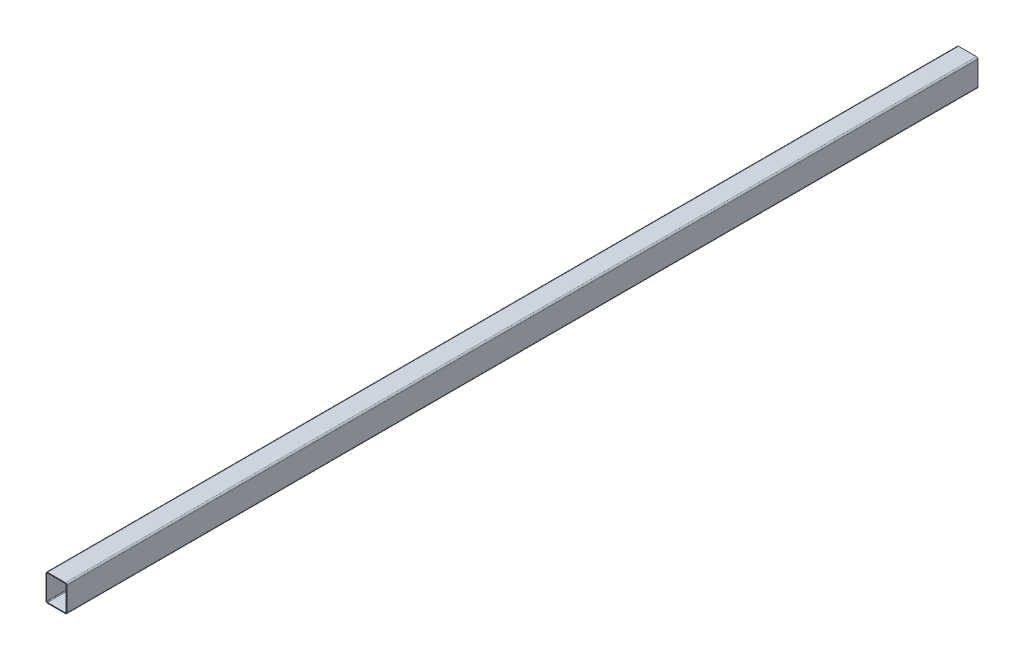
ISO-10303-21;
HEADER;
FILE_DESCRIPTION(('STEP AP214'),'2;1');
FILE_NAME('part.step','',(''),(''),'','','');
FILE_SCHEMA(('AUTOMOTIVE_DESIGN { 1 0 10303 214 1 1 1 1 }'));
ENDSEC;
DATA;
#1=APPLICATION_CONTEXT('core data for automotive mechanical design processes');
#2=APPLICATION_PROTOCOL_DEFINITION('international standard','automotive_design',2000,#1);
#3=PRODUCT_CONTEXT('',#1,'mechanical');
#4=PRODUCT('Part','Part','',(#3));
#5=PRODUCT_RELATED_PRODUCT_CATEGORY('part','',(#4));
#6=PRODUCT_DEFINITION_FORMATION('','',#4);
#7=PRODUCT_DEFINITION_CONTEXT('part definition',#1,'design');
#8=PRODUCT_DEFINITION('design','',#6,#7);
#9=PRODUCT_DEFINITION_SHAPE('','',#8);
#10=(LENGTH_UNIT() NAMED_UNIT(*) SI_UNIT(.MILLI.,.METRE.));
#11=(NAMED_UNIT(*) PLANE_ANGLE_UNIT() SI_UNIT($,.RADIAN.));
#12=(NAMED_UNIT(*) SI_UNIT($,.STERADIAN.) SOLID_ANGLE_UNIT());
#13=UNCERTAINTY_MEASURE_WITH_UNIT(LENGTH_MEASURE(1.E-05),#10,'distance_accuracy_value','');
#14=(GEOMETRIC_REPRESENTATION_CONTEXT(3) GLOBAL_UNCERTAINTY_ASSIGNED_CONTEXT((#13)) GLOBAL_UNIT_ASSIGNED_CONTEXT((#10,
#11,#12)) REPRESENTATION_CONTEXT('',''));
#15=CARTESIAN_POINT('',(0.,0.,0.));
#16=DIRECTION('',(0.,0.,1.));
#17=DIRECTION('',(1.,0.,0.));
#18=AXIS2_PLACEMENT_3D('',#15,#16,#17);
#19=CARTESIAN_POINT('',(0.586806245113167,8.57650481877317,304.8));
#20=DIRECTION('',(0.,0.,1.));
#21=DIRECTION('',(1.,0.,0.));
#22=AXIS2_PLACEMENT_3D('',#19,#20,#21);
#23=PLANE('',#22);
#24=CARTESIAN_POINT('',(0.586806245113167,8.57650481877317,304.8));
#25=DIRECTION('',(0.,0.,1.));
#26=DIRECTION('',(1.,0.,0.));
#27=AXIS2_PLACEMENT_3D('',#24,#25,#26);
#28=CIRCLE('',#27,0.5);
#29=CARTESIAN_POINT('',(0.586806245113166,9.07650481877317,304.8));
#30=VERTEX_POINT('',#29);
#31=CARTESIAN_POINT('',(0.0868062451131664,8.57650481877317,304.8));
#32=VERTEX_POINT('',#31);
#33=EDGE_CURVE('E211',#30,#32,#28,.T.);
#34=ORIENTED_EDGE('',*,*,#33,.T.);
#35=DIRECTION('',(0.,-1.,0.));
#36=VECTOR('',#35,1.);
#37=CARTESIAN_POINT('',(0.0868062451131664,0.576504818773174,304.8));
#38=LINE('',#37,#36);
#39=CARTESIAN_POINT('',(0.0868062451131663,0.576504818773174,304.8));
#40=VERTEX_POINT('',#39);
#41=EDGE_CURVE('E214',#32,#40,#38,.T.);
#42=ORIENTED_EDGE('',*,*,#41,.T.);
#43=CARTESIAN_POINT('',(0.586806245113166,0.576504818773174,304.8));
#44=DIRECTION('',(0.,0.,1.));
#45=DIRECTION('',(1.,0.,0.));
#46=AXIS2_PLACEMENT_3D('',#43,#44,#45);
#47=CIRCLE('',#46,0.5);
#48=CARTESIAN_POINT('',(0.586806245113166,0.0765048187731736,304.8));
#49=VERTEX_POINT('',#48);
#50=EDGE_CURVE('E217',#40,#49,#47,.T.);
#51=ORIENTED_EDGE('',*,*,#50,.T.);
#52=DIRECTION('',(1.,0.,0.));
#53=VECTOR('',#52,1.);
#54=CARTESIAN_POINT('',(6.58680624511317,0.0765048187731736,304.8));
#55=LINE('',#54,#53);
#56=CARTESIAN_POINT('',(6.58680624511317,0.0765048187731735,304.8));
#57=VERTEX_POINT('',#56);
#58=EDGE_CURVE('E219',#49,#57,#55,.T.);
#59=ORIENTED_EDGE('',*,*,#58,.T.);
#60=CARTESIAN_POINT('',(6.58680624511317,0.576504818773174,304.8));
#61=DIRECTION('',(0.,0.,1.));
#62=DIRECTION('',(1.,0.,0.));
#63=AXIS2_PLACEMENT_3D('',#60,#61,#62);
#64=CIRCLE('',#63,0.5);
#65=CARTESIAN_POINT('',(7.08680624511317,0.576504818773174,304.8));
#66=VERTEX_POINT('',#65);
#67=EDGE_CURVE('E221',#57,#66,#64,.T.);
#68=ORIENTED_EDGE('',*,*,#67,.T.);
#69=DIRECTION('',(0.,1.,0.));
#70=VECTOR('',#69,1.);
#71=CARTESIAN_POINT('',(7.08680624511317,8.57650481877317,304.8));
#72=LINE('',#71,#70);
#73=CARTESIAN_POINT('',(7.08680624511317,8.57650481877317,304.8));
#74=VERTEX_POINT('',#73);
#75=EDGE_CURVE('E223',#66,#74,#72,.T.);
#76=ORIENTED_EDGE('',*,*,#75,.T.);
#77=CARTESIAN_POINT('',(6.58680624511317,8.57650481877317,304.8));
#78=DIRECTION('',(0.,0.,1.));
#79=DIRECTION('',(1.,0.,0.));
#80=AXIS2_PLACEMENT_3D('',#77,#78,#79);
#81=CIRCLE('',#80,0.5);
#82=CARTESIAN_POINT('',(6.58680624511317,9.07650481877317,304.8));
#83=VERTEX_POINT('',#82);
#84=EDGE_CURVE('E225',#74,#83,#81,.T.);
#85=ORIENTED_EDGE('',*,*,#84,.T.);
#86=DIRECTION('',(-1.,0.,0.));
#87=VECTOR('',#86,1.);
#88=CARTESIAN_POINT('',(0.586806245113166,9.07650481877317,304.8));
#89=LINE('',#88,#87);
#90=EDGE_CURVE('E227',#83,#30,#89,.T.);
#91=ORIENTED_EDGE('',*,*,#90,.T.);
#92=EDGE_LOOP('',(#34,#42,#51,#59,#68,#76,#85,#91));
#93=FACE_BOUND('',#92,.T.);
#94=DIRECTION('',(0.,-1.,0.));
#95=VECTOR('',#94,1.);
#96=CARTESIAN_POINT('',(0.336806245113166,0.576504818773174,304.8));
#97=LINE('',#96,#95);
#98=CARTESIAN_POINT('',(0.336806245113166,8.57650481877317,304.8));
#99=VERTEX_POINT('',#98);
#100=CARTESIAN_POINT('',(0.336806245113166,0.576504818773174,304.8));
#101=VERTEX_POINT('',#100);
#102=EDGE_CURVE('E154',#99,#101,#97,.T.);
#103=ORIENTED_EDGE('',*,*,#102,.F.);
#104=CARTESIAN_POINT('',(0.586806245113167,8.57650481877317,304.8));
#105=DIRECTION('',(0.,0.,1.));
#106=DIRECTION('',(1.,0.,0.));
#107=AXIS2_PLACEMENT_3D('',#104,#105,#106);
#108=CIRCLE('',#107,0.25);
#109=CARTESIAN_POINT('',(0.586806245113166,8.82650481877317,304.8));
#110=VERTEX_POINT('',#109);
#111=EDGE_CURVE('E146',#110,#99,#108,.T.);
#112=ORIENTED_EDGE('',*,*,#111,.F.);
#113=DIRECTION('',(-1.,0.,0.));
#114=VECTOR('',#113,1.);
#115=CARTESIAN_POINT('',(0.586806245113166,8.82650481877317,304.8));
#116=LINE('',#115,#114);
#117=CARTESIAN_POINT('',(6.58680624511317,8.82650481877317,304.8));
#118=VERTEX_POINT('',#117);
#119=EDGE_CURVE('E179',#118,#110,#116,.T.);
#120=ORIENTED_EDGE('',*,*,#119,.F.);
#121=CARTESIAN_POINT('',(6.58680624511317,8.57650481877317,304.8));
#122=DIRECTION('',(0.,0.,1.));
#123=DIRECTION('',(1.,0.,0.));
#124=AXIS2_PLACEMENT_3D('',#121,#122,#123);
#125=CIRCLE('',#124,0.25);
#126=CARTESIAN_POINT('',(6.83680624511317,8.57650481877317,304.8));
#127=VERTEX_POINT('',#126);
#128=EDGE_CURVE('E177',#127,#118,#125,.T.);
#129=ORIENTED_EDGE('',*,*,#128,.F.);
#130=DIRECTION('',(0.,1.,0.));
#131=VECTOR('',#130,1.);
#132=CARTESIAN_POINT('',(6.83680624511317,8.57650481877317,304.8));
#133=LINE('',#132,#131);
#134=CARTESIAN_POINT('',(6.83680624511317,0.576504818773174,304.8));
#135=VERTEX_POINT('',#134);
#136=EDGE_CURVE('E175',#135,#127,#133,.T.);
#137=ORIENTED_EDGE('',*,*,#136,.F.);
#138=CARTESIAN_POINT('',(6.58680624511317,0.576504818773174,304.8));
#139=DIRECTION('',(0.,0.,1.));
#140=DIRECTION('',(1.,0.,0.));
#141=AXIS2_PLACEMENT_3D('',#138,#139,#140);
#142=CIRCLE('',#141,0.25);
#143=CARTESIAN_POINT('',(6.58680624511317,0.326504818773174,304.8));
#144=VERTEX_POINT('',#143);
#145=EDGE_CURVE('E173',#144,#135,#142,.T.);
#146=ORIENTED_EDGE('',*,*,#145,.F.);
#147=DIRECTION('',(1.,0.,0.));
#148=VECTOR('',#147,1.);
#149=CARTESIAN_POINT('',(6.58680624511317,0.326504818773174,304.8));
#150=LINE('',#149,#148);
#151=CARTESIAN_POINT('',(0.586806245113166,0.326504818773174,304.8));
#152=VERTEX_POINT('',#151);
#153=EDGE_CURVE('E169',#152,#144,#150,.T.);
#154=ORIENTED_EDGE('',*,*,#153,.F.);
#155=CARTESIAN_POINT('',(0.586806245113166,0.576504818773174,304.8));
#156=DIRECTION('',(0.,0.,1.));
#157=DIRECTION('',(1.,0.,0.));
#158=AXIS2_PLACEMENT_3D('',#155,#156,#157);
#159=CIRCLE('',#158,0.25);
#160=EDGE_CURVE('E167',#101,#152,#159,.T.);
#161=ORIENTED_EDGE('',*,*,#160,.F.);
#162=EDGE_LOOP('',(#103,#112,#120,#129,#137,#146,#154,#161));
#163=FACE_BOUND('',#162,.T.);
#164=ADVANCED_FACE('F33',(#93,#163),#23,.T.);
#165=CARTESIAN_POINT('',(0.586806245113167,8.57650481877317,0.));
#166=DIRECTION('',(0.,0.,1.));
#167=DIRECTION('',(1.,0.,0.));
#168=AXIS2_PLACEMENT_3D('',#165,#166,#167);
#169=PLANE('',#168);
#170=CARTESIAN_POINT('',(0.586806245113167,8.57650481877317,0.));
#171=DIRECTION('',(0.,0.,1.));
#172=DIRECTION('',(1.,0.,0.));
#173=AXIS2_PLACEMENT_3D('',#170,#171,#172);
#174=CIRCLE('',#173,0.5);
#175=CARTESIAN_POINT('',(0.586806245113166,9.07650481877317,0.));
#176=VERTEX_POINT('',#175);
#177=CARTESIAN_POINT('',(0.0868062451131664,8.57650481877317,0.));
#178=VERTEX_POINT('',#177);
#179=EDGE_CURVE('E162',#176,#178,#174,.T.);
#180=ORIENTED_EDGE('',*,*,#179,.F.);
#181=DIRECTION('',(-1.,0.,0.));
#182=VECTOR('',#181,1.);
#183=CARTESIAN_POINT('',(0.586806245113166,9.07650481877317,0.));
#184=LINE('',#183,#182);
#185=CARTESIAN_POINT('',(6.58680624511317,9.07650481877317,0.));
#186=VERTEX_POINT('',#185);
#187=EDGE_CURVE('E215',#186,#176,#184,.T.);
#188=ORIENTED_EDGE('',*,*,#187,.F.);
#189=CARTESIAN_POINT('',(6.58680624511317,8.57650481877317,0.));
#190=DIRECTION('',(0.,0.,1.));
#191=DIRECTION('',(1.,0.,0.));
#192=AXIS2_PLACEMENT_3D('',#189,#190,#191);
#193=CIRCLE('',#192,0.5);
#194=CARTESIAN_POINT('',(7.08680624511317,8.57650481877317,0.));
#195=VERTEX_POINT('',#194);
#196=EDGE_CURVE('E242',#195,#186,#193,.T.);
#197=ORIENTED_EDGE('',*,*,#196,.F.);
#198=DIRECTION('',(0.,1.,0.));
#199=VECTOR('',#198,1.);
#200=CARTESIAN_POINT('',(7.08680624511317,8.57650481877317,0.));
#201=LINE('',#200,#199);
#202=CARTESIAN_POINT('',(7.08680624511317,0.576504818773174,0.));
#203=VERTEX_POINT('',#202);
#204=EDGE_CURVE('E240',#203,#195,#201,.T.);
#205=ORIENTED_EDGE('',*,*,#204,.F.);
#206=CARTESIAN_POINT('',(6.58680624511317,0.576504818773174,0.));
#207=DIRECTION('',(0.,0.,1.));
#208=DIRECTION('',(1.,0.,0.));
#209=AXIS2_PLACEMENT_3D('',#206,#207,#208);
#210=CIRCLE('',#209,0.5);
#211=CARTESIAN_POINT('',(6.58680624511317,0.0765048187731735,0.));
#212=VERTEX_POINT('',#211);
#213=EDGE_CURVE('E238',#212,#203,#210,.T.);
#214=ORIENTED_EDGE('',*,*,#213,.F.);
#215=DIRECTION('',(1.,0.,0.));
#216=VECTOR('',#215,1.);
#217=CARTESIAN_POINT('',(6.58680624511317,0.0765048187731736,0.));
#218=LINE('',#217,#216);
#219=CARTESIAN_POINT('',(0.586806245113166,0.0765048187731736,0.));
#220=VERTEX_POINT('',#219);
#221=EDGE_CURVE('E236',#220,#212,#218,.T.);
#222=ORIENTED_EDGE('',*,*,#221,.F.);
#223=CARTESIAN_POINT('',(0.586806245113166,0.576504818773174,0.));
#224=DIRECTION('',(0.,0.,1.));
#225=DIRECTION('',(1.,0.,0.));
#226=AXIS2_PLACEMENT_3D('',#223,#224,#225);
#227=CIRCLE('',#226,0.5);
#228=CARTESIAN_POINT('',(0.0868062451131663,0.576504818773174,0.));
#229=VERTEX_POINT('',#228);
#230=EDGE_CURVE('E234',#229,#220,#227,.T.);
#231=ORIENTED_EDGE('',*,*,#230,.F.);
#232=DIRECTION('',(0.,-1.,0.));
#233=VECTOR('',#232,1.);
#234=CARTESIAN_POINT('',(0.0868062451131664,0.576504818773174,0.));
#235=LINE('',#234,#233);
#236=EDGE_CURVE('E232',#178,#229,#235,.T.);
#237=ORIENTED_EDGE('',*,*,#236,.F.);
#238=EDGE_LOOP('',(#180,#188,#197,#205,#214,#222,#231,#237));
#239=FACE_BOUND('',#238,.T.);
#240=CARTESIAN_POINT('',(0.586806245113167,8.57650481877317,0.));
#241=DIRECTION('',(0.,0.,1.));
#242=DIRECTION('',(1.,0.,0.));
#243=AXIS2_PLACEMENT_3D('',#240,#241,#242);
#244=CIRCLE('',#243,0.25);
#245=CARTESIAN_POINT('',(0.586806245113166,8.82650481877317,0.));
#246=VERTEX_POINT('',#245);
#247=CARTESIAN_POINT('',(0.336806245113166,8.57650481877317,0.));
#248=VERTEX_POINT('',#247);
#249=EDGE_CURVE('E56',#246,#248,#244,.T.);
#250=ORIENTED_EDGE('',*,*,#249,.T.);
#251=DIRECTION('',(0.,-1.,0.));
#252=VECTOR('',#251,1.);
#253=CARTESIAN_POINT('',(0.336806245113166,0.576504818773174,0.));
#254=LINE('',#253,#252);
#255=CARTESIAN_POINT('',(0.336806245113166,0.576504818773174,0.));
#256=VERTEX_POINT('',#255);
#257=EDGE_CURVE('E161',#248,#256,#254,.T.);
#258=ORIENTED_EDGE('',*,*,#257,.T.);
#259=CARTESIAN_POINT('',(0.586806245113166,0.576504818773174,0.));
#260=DIRECTION('',(0.,0.,1.));
#261=DIRECTION('',(1.,0.,0.));
#262=AXIS2_PLACEMENT_3D('',#259,#260,#261);
#263=CIRCLE('',#262,0.25);
#264=CARTESIAN_POINT('',(0.586806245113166,0.326504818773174,0.));
#265=VERTEX_POINT('',#264);
#266=EDGE_CURVE('E183',#256,#265,#263,.T.);
#267=ORIENTED_EDGE('',*,*,#266,.T.);
#268=DIRECTION('',(1.,0.,0.));
#269=VECTOR('',#268,1.);
#270=CARTESIAN_POINT('',(6.58680624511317,0.326504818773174,0.));
#271=LINE('',#270,#269);
#272=CARTESIAN_POINT('',(6.58680624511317,0.326504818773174,0.));
#273=VERTEX_POINT('',#272);
#274=EDGE_CURVE('E186',#265,#273,#271,.T.);
#275=ORIENTED_EDGE('',*,*,#274,.T.);
#276=CARTESIAN_POINT('',(6.58680624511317,0.576504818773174,0.));
#277=DIRECTION('',(0.,0.,1.));
#278=DIRECTION('',(1.,0.,0.));
#279=AXIS2_PLACEMENT_3D('',#276,#277,#278);
#280=CIRCLE('',#279,0.25);
#281=CARTESIAN_POINT('',(6.83680624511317,0.576504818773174,0.));
#282=VERTEX_POINT('',#281);
#283=EDGE_CURVE('E189',#273,#282,#280,.T.);
#284=ORIENTED_EDGE('',*,*,#283,.T.);
#285=DIRECTION('',(0.,1.,0.));
#286=VECTOR('',#285,1.);
#287=CARTESIAN_POINT('',(6.83680624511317,8.57650481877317,0.));
#288=LINE('',#287,#286);
#289=CARTESIAN_POINT('',(6.83680624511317,8.57650481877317,0.));
#290=VERTEX_POINT('',#289);
#291=EDGE_CURVE('E192',#282,#290,#288,.T.);
#292=ORIENTED_EDGE('',*,*,#291,.T.);
#293=CARTESIAN_POINT('',(6.58680624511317,8.57650481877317,0.));
#294=DIRECTION('',(0.,0.,1.));
#295=DIRECTION('',(1.,0.,0.));
#296=AXIS2_PLACEMENT_3D('',#293,#294,#295);
#297=CIRCLE('',#296,0.25);
#298=CARTESIAN_POINT('',(6.58680624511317,8.82650481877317,0.));
#299=VERTEX_POINT('',#298);
#300=EDGE_CURVE('E195',#290,#299,#297,.T.);
#301=ORIENTED_EDGE('',*,*,#300,.T.);
#302=DIRECTION('',(-1.,0.,0.));
#303=VECTOR('',#302,1.);
#304=CARTESIAN_POINT('',(0.586806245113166,8.82650481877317,0.));
#305=LINE('',#304,#303);
#306=EDGE_CURVE('E155',#299,#246,#305,.T.);
#307=ORIENTED_EDGE('',*,*,#306,.T.);
#308=EDGE_LOOP('',(#250,#258,#267,#275,#284,#292,#301,#307));
#309=FACE_BOUND('',#308,.T.);
#310=ADVANCED_FACE('F272',(#239,#309),#169,.F.);
#311=CARTESIAN_POINT('',(0.586806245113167,8.57650481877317,304.8));
#312=DIRECTION('',(0.,0.,-1.));
#313=DIRECTION('',(-1.,0.,0.));
#314=AXIS2_PLACEMENT_3D('',#311,#312,#313);
#315=CYLINDRICAL_SURFACE('',#314,0.5);
#316=ORIENTED_EDGE('',*,*,#179,.T.);
#317=DIRECTION('',(0.,0.,-1.));
#318=VECTOR('',#317,1.);
#319=CARTESIAN_POINT('',(0.0868062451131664,8.57650481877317,304.8));
#320=LINE('',#319,#318);
#321=EDGE_CURVE('E11',#32,#178,#320,.T.);
#322=ORIENTED_EDGE('',*,*,#321,.F.);
#323=ORIENTED_EDGE('',*,*,#33,.F.);
#324=DIRECTION('',(0.,0.,-1.));
#325=VECTOR('',#324,1.);
#326=CARTESIAN_POINT('',(0.586806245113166,9.07650481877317,304.8));
#327=LINE('',#326,#325);
#328=EDGE_CURVE('E229',#30,#176,#327,.T.);
#329=ORIENTED_EDGE('',*,*,#328,.T.);
#330=EDGE_LOOP('',(#316,#322,#323,#329));
#331=FACE_BOUND('',#330,.T.);
#332=ADVANCED_FACE('F35',(#331),#315,.T.);
#333=CARTESIAN_POINT('',(0.0868062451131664,0.576504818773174,304.8));
#334=DIRECTION('',(1.,0.,0.));
#335=DIRECTION('',(0.,0.,-1.));
#336=AXIS2_PLACEMENT_3D('',#333,#334,#335);
#337=PLANE('',#336);
#338=ORIENTED_EDGE('',*,*,#236,.T.);
#339=DIRECTION('',(0.,0.,-1.));
#340=VECTOR('',#339,1.);
#341=CARTESIAN_POINT('',(0.0868062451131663,0.576504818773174,304.8));
#342=LINE('',#341,#340);
#343=EDGE_CURVE('E41',#40,#229,#342,.T.);
#344=ORIENTED_EDGE('',*,*,#343,.F.);
#345=ORIENTED_EDGE('',*,*,#41,.F.);
#346=ORIENTED_EDGE('',*,*,#321,.T.);
#347=EDGE_LOOP('',(#338,#344,#345,#346));
#348=FACE_BOUND('',#347,.T.);
#349=ADVANCED_FACE('F289',(#348),#337,.F.);
#350=CARTESIAN_POINT('',(0.586806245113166,0.576504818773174,304.8));
#351=DIRECTION('',(0.,0.,-1.));
#352=DIRECTION('',(-1.,0.,0.));
#353=AXIS2_PLACEMENT_3D('',#350,#351,#352);
#354=CYLINDRICAL_SURFACE('',#353,0.5);
#355=ORIENTED_EDGE('',*,*,#230,.T.);
#356=DIRECTION('',(0.,0.,-1.));
#357=VECTOR('',#356,1.);
#358=CARTESIAN_POINT('',(0.586806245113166,0.0765048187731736,304.8));
#359=LINE('',#358,#357);
#360=EDGE_CURVE('E259',#49,#220,#359,.T.);
#361=ORIENTED_EDGE('',*,*,#360,.F.);
#362=ORIENTED_EDGE('',*,*,#50,.F.);
#363=ORIENTED_EDGE('',*,*,#343,.T.);
#364=EDGE_LOOP('',(#355,#361,#362,#363));
#365=FACE_BOUND('',#364,.T.);
#366=ADVANCED_FACE('F266',(#365),#354,.T.);
#367=CARTESIAN_POINT('',(6.58680624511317,0.0765048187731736,304.8));
#368=DIRECTION('',(0.,1.,0.));
#369=DIRECTION('',(0.,0.,1.));
#370=AXIS2_PLACEMENT_3D('',#367,#368,#369);
#371=PLANE('',#370);
#372=ORIENTED_EDGE('',*,*,#221,.T.);
#373=DIRECTION('',(0.,0.,-1.));
#374=VECTOR('',#373,1.);
#375=CARTESIAN_POINT('',(6.58680624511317,0.0765048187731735,304.8));
#376=LINE('',#375,#374);
#377=EDGE_CURVE('E256',#57,#212,#376,.T.);
#378=ORIENTED_EDGE('',*,*,#377,.F.);
#379=ORIENTED_EDGE('',*,*,#58,.F.);
#380=ORIENTED_EDGE('',*,*,#360,.T.);
#381=EDGE_LOOP('',(#372,#378,#379,#380));
#382=FACE_BOUND('',#381,.T.);
#383=ADVANCED_FACE('F278',(#382),#371,.F.);
#384=CARTESIAN_POINT('',(6.58680624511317,0.576504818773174,304.8));
#385=DIRECTION('',(0.,0.,-1.));
#386=DIRECTION('',(-1.,0.,0.));
#387=AXIS2_PLACEMENT_3D('',#384,#385,#386);
#388=CYLINDRICAL_SURFACE('',#387,0.5);
#389=ORIENTED_EDGE('',*,*,#213,.T.);
#390=DIRECTION('',(0.,0.,-1.));
#391=VECTOR('',#390,1.);
#392=CARTESIAN_POINT('',(7.08680624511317,0.576504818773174,304.8));
#393=LINE('',#392,#391);
#394=EDGE_CURVE('E253',#66,#203,#393,.T.);
#395=ORIENTED_EDGE('',*,*,#394,.F.);
#396=ORIENTED_EDGE('',*,*,#67,.F.);
#397=ORIENTED_EDGE('',*,*,#377,.T.);
#398=EDGE_LOOP('',(#389,#395,#396,#397));
#399=FACE_BOUND('',#398,.T.);
#400=ADVANCED_FACE('F282',(#399),#388,.T.);
#401=CARTESIAN_POINT('',(7.08680624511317,8.57650481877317,304.8));
#402=DIRECTION('',(-1.,0.,0.));
#403=DIRECTION('',(0.,0.,1.));
#404=AXIS2_PLACEMENT_3D('',#401,#402,#403);
#405=PLANE('',#404);
#406=ORIENTED_EDGE('',*,*,#204,.T.);
#407=DIRECTION('',(0.,0.,-1.));
#408=VECTOR('',#407,1.);
#409=CARTESIAN_POINT('',(7.08680624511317,8.57650481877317,304.8));
#410=LINE('',#409,#408);
#411=EDGE_CURVE('E250',#74,#195,#410,.T.);
#412=ORIENTED_EDGE('',*,*,#411,.F.);
#413=ORIENTED_EDGE('',*,*,#75,.F.);
#414=ORIENTED_EDGE('',*,*,#394,.T.);
#415=EDGE_LOOP('',(#406,#412,#413,#414));
#416=FACE_BOUND('',#415,.T.);
#417=ADVANCED_FACE('F302',(#416),#405,.F.);
#418=CARTESIAN_POINT('',(6.58680624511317,8.57650481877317,304.8));
#419=DIRECTION('',(0.,0.,-1.));
#420=DIRECTION('',(-1.,0.,0.));
#421=AXIS2_PLACEMENT_3D('',#418,#419,#420);
#422=CYLINDRICAL_SURFACE('',#421,0.5);
#423=ORIENTED_EDGE('',*,*,#196,.T.);
#424=DIRECTION('',(0.,0.,-1.));
#425=VECTOR('',#424,1.);
#426=CARTESIAN_POINT('',(6.58680624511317,9.07650481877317,304.8));
#427=LINE('',#426,#425);
#428=EDGE_CURVE('E247',#83,#186,#427,.T.);
#429=ORIENTED_EDGE('',*,*,#428,.F.);
#430=ORIENTED_EDGE('',*,*,#84,.F.);
#431=ORIENTED_EDGE('',*,*,#411,.T.);
#432=EDGE_LOOP('',(#423,#429,#430,#431));
#433=FACE_BOUND('',#432,.T.);
#434=ADVANCED_FACE('F300',(#433),#422,.T.);
#435=CARTESIAN_POINT('',(0.586806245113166,9.07650481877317,304.8));
#436=DIRECTION('',(0.,-1.,0.));
#437=DIRECTION('',(0.,0.,-1.));
#438=AXIS2_PLACEMENT_3D('',#435,#436,#437);
#439=PLANE('',#438);
#440=ORIENTED_EDGE('',*,*,#187,.T.);
#441=ORIENTED_EDGE('',*,*,#328,.F.);
#442=ORIENTED_EDGE('',*,*,#90,.F.);
#443=ORIENTED_EDGE('',*,*,#428,.T.);
#444=EDGE_LOOP('',(#440,#441,#442,#443));
#445=FACE_BOUND('',#444,.T.);
#446=ADVANCED_FACE('F295',(#445),#439,.F.);
#447=CARTESIAN_POINT('',(0.586806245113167,8.57650481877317,304.8));
#448=DIRECTION('',(0.,0.,-1.));
#449=DIRECTION('',(-1.,0.,0.));
#450=AXIS2_PLACEMENT_3D('',#447,#448,#449);
#451=CYLINDRICAL_SURFACE('',#450,0.25);
#452=ORIENTED_EDGE('',*,*,#249,.F.);
#453=DIRECTION('',(0.,0.,-1.));
#454=VECTOR('',#453,1.);
#455=CARTESIAN_POINT('',(0.586806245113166,8.82650481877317,304.8));
#456=LINE('',#455,#454);
#457=EDGE_CURVE('E150',#110,#246,#456,.T.);
#458=ORIENTED_EDGE('',*,*,#457,.F.);
#459=ORIENTED_EDGE('',*,*,#111,.T.);
#460=DIRECTION('',(0.,0.,-1.));
#461=VECTOR('',#460,1.);
#462=CARTESIAN_POINT('',(0.336806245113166,8.57650481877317,304.8));
#463=LINE('',#462,#461);
#464=EDGE_CURVE('E149',#99,#248,#463,.T.);
#465=ORIENTED_EDGE('',*,*,#464,.T.);
#466=EDGE_LOOP('',(#452,#458,#459,#465));
#467=FACE_BOUND('',#466,.T.);
#468=ADVANCED_FACE('F148',(#467),#451,.F.);
#469=CARTESIAN_POINT('',(0.336806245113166,0.576504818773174,304.8));
#470=DIRECTION('',(1.,0.,0.));
#471=DIRECTION('',(0.,0.,-1.));
#472=AXIS2_PLACEMENT_3D('',#469,#470,#471);
#473=PLANE('',#472);
#474=ORIENTED_EDGE('',*,*,#257,.F.);
#475=ORIENTED_EDGE('',*,*,#464,.F.);
#476=ORIENTED_EDGE('',*,*,#102,.T.);
#477=DIRECTION('',(0.,0.,-1.));
#478=VECTOR('',#477,1.);
#479=CARTESIAN_POINT('',(0.336806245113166,0.576504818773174,304.8));
#480=LINE('',#479,#478);
#481=EDGE_CURVE('E163',#101,#256,#480,.T.);
#482=ORIENTED_EDGE('',*,*,#481,.T.);
#483=EDGE_LOOP('',(#474,#475,#476,#482));
#484=FACE_BOUND('',#483,.T.);
#485=ADVANCED_FACE('F158',(#484),#473,.T.);
#486=CARTESIAN_POINT('',(0.586806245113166,0.576504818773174,304.8));
#487=DIRECTION('',(0.,0.,-1.));
#488=DIRECTION('',(-1.,0.,0.));
#489=AXIS2_PLACEMENT_3D('',#486,#487,#488);
#490=CYLINDRICAL_SURFACE('',#489,0.25);
#491=ORIENTED_EDGE('',*,*,#266,.F.);
#492=ORIENTED_EDGE('',*,*,#481,.F.);
#493=ORIENTED_EDGE('',*,*,#160,.T.);
#494=DIRECTION('',(0.,0.,-1.));
#495=VECTOR('',#494,1.);
#496=CARTESIAN_POINT('',(0.586806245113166,0.326504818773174,304.8));
#497=LINE('',#496,#495);
#498=EDGE_CURVE('E208',#152,#265,#497,.T.);
#499=ORIENTED_EDGE('',*,*,#498,.T.);
#500=EDGE_LOOP('',(#491,#492,#493,#499));
#501=FACE_BOUND('',#500,.T.);
#502=ADVANCED_FACE('F327',(#501),#490,.F.);
#503=CARTESIAN_POINT('',(6.58680624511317,0.326504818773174,304.8));
#504=DIRECTION('',(0.,1.,0.));
#505=DIRECTION('',(0.,0.,1.));
#506=AXIS2_PLACEMENT_3D('',#503,#504,#505);
#507=PLANE('',#506);
#508=ORIENTED_EDGE('',*,*,#274,.F.);
#509=ORIENTED_EDGE('',*,*,#498,.F.);
#510=ORIENTED_EDGE('',*,*,#153,.T.);
#511=DIRECTION('',(0.,0.,-1.));
#512=VECTOR('',#511,1.);
#513=CARTESIAN_POINT('',(6.58680624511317,0.326504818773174,304.8));
#514=LINE('',#513,#512);
#515=EDGE_CURVE('E206',#144,#273,#514,.T.);
#516=ORIENTED_EDGE('',*,*,#515,.T.);
#517=EDGE_LOOP('',(#508,#509,#510,#516));
#518=FACE_BOUND('',#517,.T.);
#519=ADVANCED_FACE('F331',(#518),#507,.T.);
#520=CARTESIAN_POINT('',(6.58680624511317,0.576504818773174,304.8));
#521=DIRECTION('',(0.,0.,-1.));
#522=DIRECTION('',(-1.,0.,0.));
#523=AXIS2_PLACEMENT_3D('',#520,#521,#522);
#524=CYLINDRICAL_SURFACE('',#523,0.25);
#525=ORIENTED_EDGE('',*,*,#283,.F.);
#526=ORIENTED_EDGE('',*,*,#515,.F.);
#527=ORIENTED_EDGE('',*,*,#145,.T.);
#528=DIRECTION('',(0.,0.,-1.));
#529=VECTOR('',#528,1.);
#530=CARTESIAN_POINT('',(6.83680624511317,0.576504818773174,304.8));
#531=LINE('',#530,#529);
#532=EDGE_CURVE('E204',#135,#282,#531,.T.);
#533=ORIENTED_EDGE('',*,*,#532,.T.);
#534=EDGE_LOOP('',(#525,#526,#527,#533));
#535=FACE_BOUND('',#534,.T.);
#536=ADVANCED_FACE('F337',(#535),#524,.F.);
#537=CARTESIAN_POINT('',(6.83680624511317,8.57650481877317,304.8));
#538=DIRECTION('',(-1.,0.,0.));
#539=DIRECTION('',(0.,0.,1.));
#540=AXIS2_PLACEMENT_3D('',#537,#538,#539);
#541=PLANE('',#540);
#542=ORIENTED_EDGE('',*,*,#291,.F.);
#543=ORIENTED_EDGE('',*,*,#532,.F.);
#544=ORIENTED_EDGE('',*,*,#136,.T.);
#545=DIRECTION('',(0.,0.,-1.));
#546=VECTOR('',#545,1.);
#547=CARTESIAN_POINT('',(6.83680624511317,8.57650481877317,304.8));
#548=LINE('',#547,#546);
#549=EDGE_CURVE('E202',#127,#290,#548,.T.);
#550=ORIENTED_EDGE('',*,*,#549,.T.);
#551=EDGE_LOOP('',(#542,#543,#544,#550));
#552=FACE_BOUND('',#551,.T.);
#553=ADVANCED_FACE('F341',(#552),#541,.T.);
#554=CARTESIAN_POINT('',(6.58680624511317,8.57650481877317,304.8));
#555=DIRECTION('',(0.,0.,-1.));
#556=DIRECTION('',(-1.,0.,0.));
#557=AXIS2_PLACEMENT_3D('',#554,#555,#556);
#558=CYLINDRICAL_SURFACE('',#557,0.25);
#559=ORIENTED_EDGE('',*,*,#300,.F.);
#560=ORIENTED_EDGE('',*,*,#549,.F.);
#561=ORIENTED_EDGE('',*,*,#128,.T.);
#562=DIRECTION('',(0.,0.,-1.));
#563=VECTOR('',#562,1.);
#564=CARTESIAN_POINT('',(6.58680624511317,8.82650481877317,304.8));
#565=LINE('',#564,#563);
#566=EDGE_CURVE('E48',#118,#299,#565,.T.);
#567=ORIENTED_EDGE('',*,*,#566,.T.);
#568=EDGE_LOOP('',(#559,#560,#561,#567));
#569=FACE_BOUND('',#568,.T.);
#570=ADVANCED_FACE('F345',(#569),#558,.F.);
#571=CARTESIAN_POINT('',(0.586806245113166,8.82650481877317,304.8));
#572=DIRECTION('',(0.,-1.,0.));
#573=DIRECTION('',(0.,0.,-1.));
#574=AXIS2_PLACEMENT_3D('',#571,#572,#573);
#575=PLANE('',#574);
#576=ORIENTED_EDGE('',*,*,#306,.F.);
#577=ORIENTED_EDGE('',*,*,#566,.F.);
#578=ORIENTED_EDGE('',*,*,#119,.T.);
#579=ORIENTED_EDGE('',*,*,#457,.T.);
#580=EDGE_LOOP('',(#576,#577,#578,#579));
#581=FACE_BOUND('',#580,.T.);
#582=ADVANCED_FACE('F349',(#581),#575,.T.);
#583=CLOSED_SHELL('',(#164,#310,#332,#349,#366,#383,#400,#417,#434,#446,#468,#485,#502,#519,
#536,#553,#570,#582));
#584=MANIFOLD_SOLID_BREP('B2',#583);
#585=ADVANCED_BREP_SHAPE_REPRESENTATION('',(#18,#584),#14);
#586=SHAPE_DEFINITION_REPRESENTATION(#9,#585);
ENDSEC;
END-ISO-10303-21;
